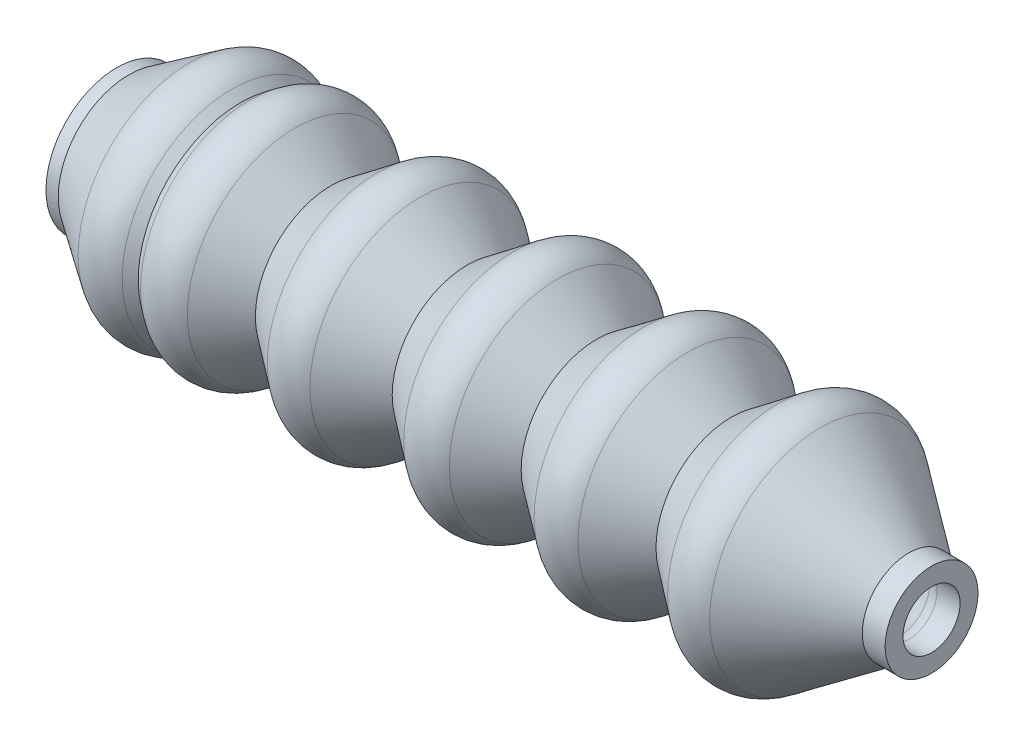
ISO-10303-21;
HEADER;
FILE_DESCRIPTION(('STEP AP214'),'2;1');
FILE_NAME('part.step','',(''),(''),'','','');
FILE_SCHEMA(('AUTOMOTIVE_DESIGN { 1 0 10303 214 1 1 1 1 }'));
ENDSEC;
DATA;
#1=APPLICATION_CONTEXT('core data for automotive mechanical design processes');
#2=APPLICATION_PROTOCOL_DEFINITION('international standard','automotive_design',2000,#1);
#3=PRODUCT_CONTEXT('',#1,'mechanical');
#4=PRODUCT('Part','Part','',(#3));
#5=PRODUCT_RELATED_PRODUCT_CATEGORY('part','',(#4));
#6=PRODUCT_DEFINITION_FORMATION('','',#4);
#7=PRODUCT_DEFINITION_CONTEXT('part definition',#1,'design');
#8=PRODUCT_DEFINITION('design','',#6,#7);
#9=PRODUCT_DEFINITION_SHAPE('','',#8);
#10=(LENGTH_UNIT() NAMED_UNIT(*) SI_UNIT(.MILLI.,.METRE.));
#11=(NAMED_UNIT(*) PLANE_ANGLE_UNIT() SI_UNIT($,.RADIAN.));
#12=(NAMED_UNIT(*) SI_UNIT($,.STERADIAN.) SOLID_ANGLE_UNIT());
#13=UNCERTAINTY_MEASURE_WITH_UNIT(LENGTH_MEASURE(1.E-05),#10,'distance_accuracy_value','');
#14=(GEOMETRIC_REPRESENTATION_CONTEXT(3) GLOBAL_UNCERTAINTY_ASSIGNED_CONTEXT((#13)) GLOBAL_UNIT_ASSIGNED_CONTEXT((#10,
#11,#12)) REPRESENTATION_CONTEXT('',''));
#15=CARTESIAN_POINT('',(0.,0.,0.));
#16=DIRECTION('',(0.,0.,1.));
#17=DIRECTION('',(1.,0.,0.));
#18=AXIS2_PLACEMENT_3D('',#15,#16,#17);
#19=CARTESIAN_POINT('',(235.621796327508,156.349479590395,0.));
#20=DIRECTION('',(1.,0.,0.));
#21=DIRECTION('',(0.,1.,0.));
#22=AXIS2_PLACEMENT_3D('',#19,#20,#21);
#23=PLANE('',#22);
#24=CARTESIAN_POINT('',(235.621796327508,157.626056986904,0.));
#25=DIRECTION('',(1.,0.,0.));
#26=DIRECTION('',(0.,1.,0.));
#27=AXIS2_PLACEMENT_3D('',#24,#25,#26);
#28=CIRCLE('',#27,2.07657739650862);
#29=CARTESIAN_POINT('',(235.621796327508,159.702634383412,0.));
#30=VERTEX_POINT('',#29);
#31=EDGE_CURVE('E34',#30,#30,#28,.F.);
#32=ORIENTED_EDGE('',*,*,#31,.F.);
#33=EDGE_LOOP('',(#32));
#34=FACE_BOUND('',#33,.T.);
#35=CARTESIAN_POINT('',(235.621796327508,157.626056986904,0.));
#36=DIRECTION('',(-1.,0.,0.));
#37=DIRECTION('',(0.,-1.,0.));
#38=AXIS2_PLACEMENT_3D('',#35,#36,#37);
#39=CIRCLE('',#38,1.27657739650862);
#40=CARTESIAN_POINT('',(235.621796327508,156.349479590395,0.));
#41=VERTEX_POINT('',#40);
#42=EDGE_CURVE('E179',#41,#41,#39,.T.);
#43=ORIENTED_EDGE('',*,*,#42,.T.);
#44=EDGE_LOOP('',(#43));
#45=FACE_BOUND('',#44,.T.);
#46=ADVANCED_FACE('F30',(#34,#45),#23,.T.);
#47=CARTESIAN_POINT('',(199.181290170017,155.264478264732,0.));
#48=DIRECTION('',(-1.,0.,0.));
#49=DIRECTION('',(0.,-1.,0.));
#50=AXIS2_PLACEMENT_3D('',#47,#48,#49);
#51=PLANE('',#50);
#52=CARTESIAN_POINT('',(199.181290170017,157.626056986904,0.));
#53=DIRECTION('',(-1.,0.,0.));
#54=DIRECTION('',(0.,-1.,0.));
#55=AXIS2_PLACEMENT_3D('',#52,#53,#54);
#56=CIRCLE('',#55,2.36157872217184);
#57=CARTESIAN_POINT('',(199.181290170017,155.264478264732,0.));
#58=VERTEX_POINT('',#57);
#59=EDGE_CURVE('E98',#58,#58,#56,.T.);
#60=ORIENTED_EDGE('',*,*,#59,.F.);
#61=EDGE_LOOP('',(#60));
#62=FACE_BOUND('',#61,.T.);
#63=CARTESIAN_POINT('',(199.181290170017,157.626056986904,0.));
#64=DIRECTION('',(-1.,0.,0.));
#65=DIRECTION('',(0.,-1.,0.));
#66=AXIS2_PLACEMENT_3D('',#63,#64,#65);
#67=CIRCLE('',#66,3.16157872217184);
#68=CARTESIAN_POINT('',(199.181290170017,154.464478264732,0.));
#69=VERTEX_POINT('',#68);
#70=EDGE_CURVE('E10',#69,#69,#67,.T.);
#71=ORIENTED_EDGE('',*,*,#70,.T.);
#72=EDGE_LOOP('',(#71));
#73=FACE_BOUND('',#72,.T.);
#74=ADVANCED_FACE('F346',(#62,#73),#51,.T.);
#75=CARTESIAN_POINT('',(199.181290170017,157.626056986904,0.));
#76=DIRECTION('',(-1.,0.,0.));
#77=DIRECTION('',(0.,-1.,0.));
#78=AXIS2_PLACEMENT_3D('',#75,#76,#77);
#79=CYLINDRICAL_SURFACE('',#78,3.16157872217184);
#80=CARTESIAN_POINT('',(199.730597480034,157.626056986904,0.));
#81=DIRECTION('',(1.,0.,0.));
#82=DIRECTION('',(0.,1.,0.));
#83=AXIS2_PLACEMENT_3D('',#80,#81,#82);
#84=CIRCLE('',#83,3.16157872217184);
#85=CARTESIAN_POINT('',(199.730597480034,160.787635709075,0.));
#86=VERTEX_POINT('',#85);
#87=EDGE_CURVE('E38',#86,#86,#84,.F.);
#88=ORIENTED_EDGE('',*,*,#87,.T.);
#89=EDGE_LOOP('',(#88));
#90=FACE_BOUND('',#89,.T.);
#91=ORIENTED_EDGE('',*,*,#70,.F.);
#92=EDGE_LOOP('',(#91));
#93=FACE_BOUND('',#92,.T.);
#94=ADVANCED_FACE('F348',(#90,#93),#79,.T.);
#95=CARTESIAN_POINT('',(199.730597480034,157.626056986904,0.));
#96=DIRECTION('',(1.,0.,0.));
#97=DIRECTION('',(0.,1.,0.));
#98=AXIS2_PLACEMENT_3D('',#95,#96,#97);
#99=CONICAL_SURFACE('',#98,3.16157872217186,0.591150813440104);
#100=CARTESIAN_POINT('',(202.436143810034,157.626056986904,0.));
#101=DIRECTION('',(1.,0.,0.));
#102=DIRECTION('',(0.,1.,0.));
#103=AXIS2_PLACEMENT_3D('',#100,#101,#102);
#104=CIRCLE('',#103,4.9776054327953);
#105=CARTESIAN_POINT('',(202.436143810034,162.603662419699,0.));
#106=VERTEX_POINT('',#105);
#107=EDGE_CURVE('E42',#106,#106,#104,.F.);
#108=ORIENTED_EDGE('',*,*,#107,.T.);
#109=EDGE_LOOP('',(#108));
#110=FACE_BOUND('',#109,.T.);
#111=ORIENTED_EDGE('',*,*,#87,.F.);
#112=EDGE_LOOP('',(#111));
#113=FACE_BOUND('',#112,.T.);
#114=ADVANCED_FACE('F354',(#110,#113),#99,.T.);
#115=CARTESIAN_POINT('',(203.327850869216,157.626056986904,0.));
#116=DIRECTION('',(-1.,0.,0.));
#117=DIRECTION('',(0.,-1.,0.));
#118=AXIS2_PLACEMENT_3D('',#115,#116,#117);
#119=TOROIDAL_SURFACE('',#118,3.64912565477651,1.60000000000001);
#120=CARTESIAN_POINT('',(204.327106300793,157.626056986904,0.));
#121=DIRECTION('',(-1.,0.,0.));
#122=DIRECTION('',(0.,-1.,0.));
#123=AXIS2_PLACEMENT_3D('',#120,#121,#122);
#124=CIRCLE('',#123,4.89872102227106);
#125=CARTESIAN_POINT('',(204.327106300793,152.727335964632,0.));
#126=VERTEX_POINT('',#125);
#127=EDGE_CURVE('E93',#126,#126,#124,.T.);
#128=ORIENTED_EDGE('',*,*,#127,.T.);
#129=EDGE_LOOP('',(#128));
#130=FACE_BOUND('',#129,.T.);
#131=ORIENTED_EDGE('',*,*,#107,.F.);
#132=EDGE_LOOP('',(#131));
#133=FACE_BOUND('',#132,.T.);
#134=ADVANCED_FACE('F362',(#130,#133),#119,.T.);
#135=CARTESIAN_POINT('',(204.327106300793,157.626056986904,0.));
#136=DIRECTION('',(-1.,0.,0.));
#137=DIRECTION('',(0.,-1.,0.));
#138=AXIS2_PLACEMENT_3D('',#135,#136,#137);
#139=CONICAL_SURFACE('',#138,4.89872102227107,0.674535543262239);
#140=CARTESIAN_POINT('',(204.725140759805,157.626056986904,0.));
#141=DIRECTION('',(-1.,0.,0.));
#142=DIRECTION('',(0.,-1.,0.));
#143=AXIS2_PLACEMENT_3D('',#140,#141,#142);
#144=CIRCLE('',#143,4.58042751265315);
#145=CARTESIAN_POINT('',(204.725140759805,153.04562947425,0.));
#146=VERTEX_POINT('',#145);
#147=EDGE_CURVE('E90',#146,#146,#144,.T.);
#148=ORIENTED_EDGE('',*,*,#147,.T.);
#149=EDGE_LOOP('',(#148));
#150=FACE_BOUND('',#149,.T.);
#151=ORIENTED_EDGE('',*,*,#127,.F.);
#152=EDGE_LOOP('',(#151));
#153=FACE_BOUND('',#152,.T.);
#154=ADVANCED_FACE('F366',(#150,#153),#139,.T.);
#155=CARTESIAN_POINT('',(204.725140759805,157.626056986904,0.));
#156=DIRECTION('',(1.,0.,0.));
#157=DIRECTION('',(0.,1.,0.));
#158=AXIS2_PLACEMENT_3D('',#155,#156,#157);
#159=CONICAL_SURFACE('',#158,4.58042751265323,0.643298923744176);
#160=CARTESIAN_POINT('',(205.138836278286,157.626056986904,0.));
#161=DIRECTION('',(1.,0.,0.));
#162=DIRECTION('',(0.,1.,0.));
#163=AXIS2_PLACEMENT_3D('',#160,#161,#162);
#164=CIRCLE('',#163,4.8905684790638);
#165=CARTESIAN_POINT('',(205.138836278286,162.516625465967,0.));
#166=VERTEX_POINT('',#165);
#167=EDGE_CURVE('E87',#166,#166,#164,.F.);
#168=ORIENTED_EDGE('',*,*,#167,.T.);
#169=EDGE_LOOP('',(#168));
#170=FACE_BOUND('',#169,.T.);
#171=ORIENTED_EDGE('',*,*,#147,.F.);
#172=EDGE_LOOP('',(#171));
#173=FACE_BOUND('',#172,.T.);
#174=ADVANCED_FACE('F370',(#170,#173),#159,.T.);
#175=CARTESIAN_POINT('',(206.098577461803,157.626056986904,0.));
#176=DIRECTION('',(-1.,0.,0.));
#177=DIRECTION('',(0.,-1.,0.));
#178=AXIS2_PLACEMENT_3D('',#175,#176,#177);
#179=TOROIDAL_SURFACE('',#178,3.61037440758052,1.60000000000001);
#180=CARTESIAN_POINT('',(207.15526681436,157.626056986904,0.));
#181=DIRECTION('',(-1.,0.,0.));
#182=DIRECTION('',(0.,-1.,0.));
#183=AXIS2_PLACEMENT_3D('',#180,#181,#182);
#184=CIRCLE('',#183,4.81179340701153);
#185=CARTESIAN_POINT('',(207.15526681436,152.814263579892,0.));
#186=VERTEX_POINT('',#185);
#187=EDGE_CURVE('E84',#186,#186,#184,.T.);
#188=ORIENTED_EDGE('',*,*,#187,.T.);
#189=EDGE_LOOP('',(#188));
#190=FACE_BOUND('',#189,.T.);
#191=ORIENTED_EDGE('',*,*,#167,.F.);
#192=EDGE_LOOP('',(#191));
#193=FACE_BOUND('',#192,.T.);
#194=ADVANCED_FACE('F374',(#190,#193),#179,.T.);
#195=CARTESIAN_POINT('',(207.15526681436,157.626056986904,0.));
#196=DIRECTION('',(-1.,0.,0.));
#197=DIRECTION('',(0.,-1.,0.));
#198=AXIS2_PLACEMENT_3D('',#195,#196,#197);
#199=CONICAL_SURFACE('',#198,4.8117934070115,0.721392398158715);
#200=CARTESIAN_POINT('',(208.772150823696,157.626056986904,0.));
#201=DIRECTION('',(-1.,0.,0.));
#202=DIRECTION('',(0.,-1.,0.));
#203=AXIS2_PLACEMENT_3D('',#200,#201,#202);
#204=CIRCLE('',#203,3.38968828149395);
#205=CARTESIAN_POINT('',(208.772150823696,154.23636870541,0.));
#206=VERTEX_POINT('',#205);
#207=EDGE_CURVE('E81',#206,#206,#204,.T.);
#208=ORIENTED_EDGE('',*,*,#207,.T.);
#209=EDGE_LOOP('',(#208));
#210=FACE_BOUND('',#209,.T.);
#211=ORIENTED_EDGE('',*,*,#187,.F.);
#212=EDGE_LOOP('',(#211));
#213=FACE_BOUND('',#212,.T.);
#214=ADVANCED_FACE('F378',(#210,#213),#199,.T.);
#215=CARTESIAN_POINT('',(208.772150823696,157.626056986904,0.));
#216=DIRECTION('',(1.,0.,0.));
#217=DIRECTION('',(0.,1.,0.));
#218=AXIS2_PLACEMENT_3D('',#215,#216,#217);
#219=CONICAL_SURFACE('',#218,3.38968828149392,0.638946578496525);
#220=CARTESIAN_POINT('',(210.843005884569,157.626056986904,0.));
#221=DIRECTION('',(1.,0.,0.));
#222=DIRECTION('',(0.,1.,0.));
#223=AXIS2_PLACEMENT_3D('',#220,#221,#222);
#224=CIRCLE('',#223,4.92814250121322);
#225=CARTESIAN_POINT('',(210.843005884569,162.554199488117,0.));
#226=VERTEX_POINT('',#225);
#227=EDGE_CURVE('E78',#226,#226,#224,.F.);
#228=ORIENTED_EDGE('',*,*,#227,.T.);
#229=EDGE_LOOP('',(#228));
#230=FACE_BOUND('',#229,.T.);
#231=ORIENTED_EDGE('',*,*,#207,.F.);
#232=EDGE_LOOP('',(#231));
#233=FACE_BOUND('',#232,.T.);
#234=ADVANCED_FACE('F382',(#230,#233),#219,.T.);
#235=CARTESIAN_POINT('',(211.797166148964,157.626056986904,0.));
#236=DIRECTION('',(-1.,0.,0.));
#237=DIRECTION('',(0.,-1.,0.));
#238=AXIS2_PLACEMENT_3D('',#235,#236,#237);
#239=TOROIDAL_SURFACE('',#238,3.64378344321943,1.6);
#240=CARTESIAN_POINT('',(212.751326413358,157.626056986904,0.));
#241=DIRECTION('',(-1.,0.,0.));
#242=DIRECTION('',(0.,-1.,0.));
#243=AXIS2_PLACEMENT_3D('',#240,#241,#242);
#244=CIRCLE('',#243,4.92814250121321);
#245=CARTESIAN_POINT('',(212.751326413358,152.69791448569,0.));
#246=VERTEX_POINT('',#245);
#247=EDGE_CURVE('E75',#246,#246,#244,.T.);
#248=ORIENTED_EDGE('',*,*,#247,.T.);
#249=EDGE_LOOP('',(#248));
#250=FACE_BOUND('',#249,.T.);
#251=ORIENTED_EDGE('',*,*,#227,.F.);
#252=EDGE_LOOP('',(#251));
#253=FACE_BOUND('',#252,.T.);
#254=ADVANCED_FACE('F386',(#250,#253),#239,.T.);
#255=CARTESIAN_POINT('',(212.751326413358,157.626056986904,0.));
#256=DIRECTION('',(-1.,0.,0.));
#257=DIRECTION('',(0.,-1.,0.));
#258=AXIS2_PLACEMENT_3D('',#255,#256,#257);
#259=CONICAL_SURFACE('',#258,4.92814250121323,0.638946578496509);
#260=CARTESIAN_POINT('',(214.862252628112,157.626056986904,0.));
#261=DIRECTION('',(-1.,0.,0.));
#262=DIRECTION('',(0.,-1.,0.));
#263=AXIS2_PLACEMENT_3D('',#260,#261,#262);
#264=CIRCLE('',#263,3.35991911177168);
#265=CARTESIAN_POINT('',(214.862252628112,154.266137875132,0.));
#266=VERTEX_POINT('',#265);
#267=EDGE_CURVE('E72',#266,#266,#264,.T.);
#268=ORIENTED_EDGE('',*,*,#267,.T.);
#269=EDGE_LOOP('',(#268));
#270=FACE_BOUND('',#269,.T.);
#271=ORIENTED_EDGE('',*,*,#247,.F.);
#272=EDGE_LOOP('',(#271));
#273=FACE_BOUND('',#272,.T.);
#274=ADVANCED_FACE('F390',(#270,#273),#259,.T.);
#275=CARTESIAN_POINT('',(214.862252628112,157.626056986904,0.));
#276=DIRECTION('',(1.,0.,0.));
#277=DIRECTION('',(0.,1.,0.));
#278=AXIS2_PLACEMENT_3D('',#275,#276,#277);
#279=CONICAL_SURFACE('',#278,3.35991911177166,0.643623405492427);
#280=CARTESIAN_POINT('',(216.913695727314,157.626056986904,0.));
#281=DIRECTION('',(1.,0.,0.));
#282=DIRECTION('',(0.,1.,0.));
#283=AXIS2_PLACEMENT_3D('',#280,#281,#282);
#284=CIRCLE('',#283,4.89889347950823);
#285=CARTESIAN_POINT('',(216.913695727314,162.524950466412,0.));
#286=VERTEX_POINT('',#285);
#287=EDGE_CURVE('E69',#286,#286,#284,.F.);
#288=ORIENTED_EDGE('',*,*,#287,.T.);
#289=EDGE_LOOP('',(#288));
#290=FACE_BOUND('',#289,.T.);
#291=ORIENTED_EDGE('',*,*,#267,.F.);
#292=EDGE_LOOP('',(#291));
#293=FACE_BOUND('',#292,.T.);
#294=ADVANCED_FACE('F394',(#290,#293),#279,.T.);
#295=CARTESIAN_POINT('',(217.873852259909,157.626056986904,0.));
#296=DIRECTION('',(-1.,0.,0.));
#297=DIRECTION('',(0.,-1.,0.));
#298=AXIS2_PLACEMENT_3D('',#295,#296,#297);
#299=TOROIDAL_SURFACE('',#298,3.61901089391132,1.59999999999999);
#300=CARTESIAN_POINT('',(218.903586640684,157.626056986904,0.));
#301=DIRECTION('',(-1.,0.,0.));
#302=DIRECTION('',(0.,-1.,0.));
#303=AXIS2_PLACEMENT_3D('',#300,#301,#302);
#304=CIRCLE('',#303,4.84361168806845);
#305=CARTESIAN_POINT('',(218.903586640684,152.782445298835,0.));
#306=VERTEX_POINT('',#305);
#307=EDGE_CURVE('E66',#306,#306,#304,.T.);
#308=ORIENTED_EDGE('',*,*,#307,.T.);
#309=EDGE_LOOP('',(#308));
#310=FACE_BOUND('',#309,.T.);
#311=ORIENTED_EDGE('',*,*,#287,.F.);
#312=EDGE_LOOP('',(#311));
#313=FACE_BOUND('',#312,.T.);
#314=ADVANCED_FACE('F398',(#310,#313),#299,.T.);
#315=CARTESIAN_POINT('',(218.903586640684,157.626056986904,0.));
#316=DIRECTION('',(-1.,0.,0.));
#317=DIRECTION('',(0.,-1.,0.));
#318=AXIS2_PLACEMENT_3D('',#315,#316,#317);
#319=CONICAL_SURFACE('',#318,4.84361168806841,0.699171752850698);
#320=CARTESIAN_POINT('',(220.64753714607,157.626056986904,0.));
#321=DIRECTION('',(-1.,0.,0.));
#322=DIRECTION('',(0.,-1.,0.));
#323=AXIS2_PLACEMENT_3D('',#320,#321,#322);
#324=CIRCLE('',#323,3.37716988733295);
#325=CARTESIAN_POINT('',(220.64753714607,154.248887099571,0.));
#326=VERTEX_POINT('',#325);
#327=EDGE_CURVE('E63',#326,#326,#324,.T.);
#328=ORIENTED_EDGE('',*,*,#327,.T.);
#329=EDGE_LOOP('',(#328));
#330=FACE_BOUND('',#329,.T.);
#331=ORIENTED_EDGE('',*,*,#307,.F.);
#332=EDGE_LOOP('',(#331));
#333=FACE_BOUND('',#332,.T.);
#334=ADVANCED_FACE('F402',(#330,#333),#319,.T.);
#335=CARTESIAN_POINT('',(220.64753714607,157.626056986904,0.));
#336=DIRECTION('',(1.,0.,0.));
#337=DIRECTION('',(0.,1.,0.));
#338=AXIS2_PLACEMENT_3D('',#335,#336,#337);
#339=CONICAL_SURFACE('',#338,3.37716988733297,0.629766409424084);
#340=CARTESIAN_POINT('',(222.780315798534,157.626056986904,0.));
#341=DIRECTION('',(1.,0.,0.));
#342=DIRECTION('',(0.,1.,0.));
#343=AXIS2_PLACEMENT_3D('',#340,#341,#342);
#344=CIRCLE('',#343,4.93144730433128);
#345=CARTESIAN_POINT('',(222.780315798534,162.557504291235,0.));
#346=VERTEX_POINT('',#345);
#347=EDGE_CURVE('E60',#346,#346,#344,.F.);
#348=ORIENTED_EDGE('',*,*,#347,.T.);
#349=EDGE_LOOP('',(#348));
#350=FACE_BOUND('',#349,.T.);
#351=ORIENTED_EDGE('',*,*,#327,.F.);
#352=EDGE_LOOP('',(#351));
#353=FACE_BOUND('',#352,.T.);
#354=ADVANCED_FACE('F406',(#350,#353),#339,.T.);
#355=CARTESIAN_POINT('',(223.72264538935,157.626056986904,0.));
#356=DIRECTION('',(-1.,0.,0.));
#357=DIRECTION('',(0.,-1.,0.));
#358=AXIS2_PLACEMENT_3D('',#355,#356,#357);
#359=TOROIDAL_SURFACE('',#358,3.63838313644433,1.59999999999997);
#360=CARTESIAN_POINT('',(224.707332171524,157.626056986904,0.));
#361=DIRECTION('',(-1.,0.,0.));
#362=DIRECTION('',(0.,-1.,0.));
#363=AXIS2_PLACEMENT_3D('',#360,#361,#362);
#364=CIRCLE('',#363,4.89949056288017);
#365=CARTESIAN_POINT('',(224.707332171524,152.726566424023,0.));
#366=VERTEX_POINT('',#365);
#367=EDGE_CURVE('E57',#366,#366,#364,.T.);
#368=ORIENTED_EDGE('',*,*,#367,.T.);
#369=EDGE_LOOP('',(#368));
#370=FACE_BOUND('',#369,.T.);
#371=ORIENTED_EDGE('',*,*,#347,.F.);
#372=EDGE_LOOP('',(#371));
#373=FACE_BOUND('',#372,.T.);
#374=ADVANCED_FACE('F410',(#370,#373),#359,.T.);
#375=CARTESIAN_POINT('',(224.707332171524,157.626056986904,0.));
#376=DIRECTION('',(-1.,0.,0.));
#377=DIRECTION('',(0.,-1.,0.));
#378=AXIS2_PLACEMENT_3D('',#375,#376,#377);
#379=CONICAL_SURFACE('',#378,4.89949056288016,0.662930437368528);
#380=CARTESIAN_POINT('',(226.667504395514,157.626056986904,0.));
#381=DIRECTION('',(-1.,0.,0.));
#382=DIRECTION('',(0.,-1.,0.));
#383=AXIS2_PLACEMENT_3D('',#380,#381,#382);
#384=CIRCLE('',#383,3.36896616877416);
#385=CARTESIAN_POINT('',(226.667504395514,154.257090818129,0.));
#386=VERTEX_POINT('',#385);
#387=EDGE_CURVE('E54',#386,#386,#384,.T.);
#388=ORIENTED_EDGE('',*,*,#387,.T.);
#389=EDGE_LOOP('',(#388));
#390=FACE_BOUND('',#389,.T.);
#391=ORIENTED_EDGE('',*,*,#367,.F.);
#392=EDGE_LOOP('',(#391));
#393=FACE_BOUND('',#392,.T.);
#394=ADVANCED_FACE('F414',(#390,#393),#379,.T.);
#395=CARTESIAN_POINT('',(226.667504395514,157.626056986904,0.));
#396=DIRECTION('',(1.,0.,0.));
#397=DIRECTION('',(0.,1.,0.));
#398=AXIS2_PLACEMENT_3D('',#395,#396,#397);
#399=CONICAL_SURFACE('',#398,3.36896616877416,0.643623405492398);
#400=CARTESIAN_POINT('',(228.743678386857,157.626056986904,0.));
#401=DIRECTION('',(1.,0.,0.));
#402=DIRECTION('',(0.,1.,0.));
#403=AXIS2_PLACEMENT_3D('',#400,#401,#402);
#404=CIRCLE('',#403,4.92649343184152);
#405=CARTESIAN_POINT('',(228.743678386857,162.552550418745,0.));
#406=VERTEX_POINT('',#405);
#407=EDGE_CURVE('E51',#406,#406,#404,.F.);
#408=ORIENTED_EDGE('',*,*,#407,.T.);
#409=EDGE_LOOP('',(#408));
#410=FACE_BOUND('',#409,.T.);
#411=ORIENTED_EDGE('',*,*,#387,.F.);
#412=EDGE_LOOP('',(#411));
#413=FACE_BOUND('',#412,.T.);
#414=ADVANCED_FACE('F418',(#410,#413),#399,.T.);
#415=CARTESIAN_POINT('',(229.703834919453,157.626056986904,0.));
#416=DIRECTION('',(-1.,0.,0.));
#417=DIRECTION('',(0.,-1.,0.));
#418=AXIS2_PLACEMENT_3D('',#415,#416,#417);
#419=TOROIDAL_SURFACE('',#418,3.64661084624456,1.59999999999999);
#420=CARTESIAN_POINT('',(230.64217922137,157.626056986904,0.));
#421=DIRECTION('',(-1.,0.,0.));
#422=DIRECTION('',(0.,-1.,0.));
#423=AXIS2_PLACEMENT_3D('',#420,#421,#422);
#424=CIRCLE('',#423,4.94256993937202);
#425=CARTESIAN_POINT('',(230.64217922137,152.683487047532,0.));
#426=VERTEX_POINT('',#425);
#427=EDGE_CURVE('E48',#426,#426,#424,.T.);
#428=ORIENTED_EDGE('',*,*,#427,.T.);
#429=EDGE_LOOP('',(#428));
#430=FACE_BOUND('',#429,.T.);
#431=ORIENTED_EDGE('',*,*,#407,.F.);
#432=EDGE_LOOP('',(#431));
#433=FACE_BOUND('',#432,.T.);
#434=ADVANCED_FACE('F422',(#430,#433),#419,.T.);
#435=CARTESIAN_POINT('',(230.64217922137,157.626056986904,0.));
#436=DIRECTION('',(-1.,0.,0.));
#437=DIRECTION('',(0.,-1.,0.));
#438=AXIS2_PLACEMENT_3D('',#435,#436,#437);
#439=CONICAL_SURFACE('',#438,4.94256993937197,0.626687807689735);
#440=CARTESIAN_POINT('',(234.600437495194,157.626056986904,0.));
#441=DIRECTION('',(-1.,0.,0.));
#442=DIRECTION('',(0.,-1.,0.));
#443=AXIS2_PLACEMENT_3D('',#440,#441,#442);
#444=CIRCLE('',#443,2.07657739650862);
#445=CARTESIAN_POINT('',(234.600437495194,155.549479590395,0.));
#446=VERTEX_POINT('',#445);
#447=EDGE_CURVE('E45',#446,#446,#444,.T.);
#448=ORIENTED_EDGE('',*,*,#447,.T.);
#449=EDGE_LOOP('',(#448));
#450=FACE_BOUND('',#449,.T.);
#451=ORIENTED_EDGE('',*,*,#427,.F.);
#452=EDGE_LOOP('',(#451));
#453=FACE_BOUND('',#452,.T.);
#454=ADVANCED_FACE('F425',(#450,#453),#439,.T.);
#455=CARTESIAN_POINT('',(199.181290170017,157.626056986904,0.));
#456=DIRECTION('',(-1.,0.,0.));
#457=DIRECTION('',(0.,-1.,0.));
#458=AXIS2_PLACEMENT_3D('',#455,#456,#457);
#459=CYLINDRICAL_SURFACE('',#458,2.07657739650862);
#460=ORIENTED_EDGE('',*,*,#31,.T.);
#461=EDGE_LOOP('',(#460));
#462=FACE_BOUND('',#461,.T.);
#463=ORIENTED_EDGE('',*,*,#447,.F.);
#464=EDGE_LOOP('',(#463));
#465=FACE_BOUND('',#464,.T.);
#466=ADVANCED_FACE('F32',(#462,#465),#459,.T.);
#467=CARTESIAN_POINT('',(199.181290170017,157.626056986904,0.));
#468=DIRECTION('',(-1.,0.,0.));
#469=DIRECTION('',(0.,-1.,0.));
#470=AXIS2_PLACEMENT_3D('',#467,#468,#469);
#471=CYLINDRICAL_SURFACE('',#470,2.36157872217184);
#472=CARTESIAN_POINT('',(199.730597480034,157.626056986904,0.));
#473=DIRECTION('',(-1.,0.,0.));
#474=DIRECTION('',(0.,-1.,0.));
#475=AXIS2_PLACEMENT_3D('',#472,#473,#474);
#476=CIRCLE('',#475,2.36157872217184);
#477=CARTESIAN_POINT('',(199.730597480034,155.264478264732,0.));
#478=VERTEX_POINT('',#477);
#479=EDGE_CURVE('E101',#478,#478,#476,.T.);
#480=ORIENTED_EDGE('',*,*,#479,.F.);
#481=EDGE_LOOP('',(#480));
#482=FACE_BOUND('',#481,.T.);
#483=ORIENTED_EDGE('',*,*,#59,.T.);
#484=EDGE_LOOP('',(#483));
#485=FACE_BOUND('',#484,.T.);
#486=ADVANCED_FACE('F337',(#482,#485),#471,.F.);
#487=CARTESIAN_POINT('',(199.730597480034,157.626056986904,0.));
#488=DIRECTION('',(-1.,0.,0.));
#489=DIRECTION('',(0.,-1.,0.));
#490=AXIS2_PLACEMENT_3D('',#487,#488,#489);
#491=TOROIDAL_SURFACE('',#490,3.16157872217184,0.799999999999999);
#492=CARTESIAN_POINT('',(200.176451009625,157.626056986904,0.));
#493=DIRECTION('',(-1.,0.,0.));
#494=DIRECTION('',(0.,-1.,0.));
#495=AXIS2_PLACEMENT_3D('',#492,#493,#494);
#496=CIRCLE('',#495,2.49733883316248);
#497=CARTESIAN_POINT('',(200.176451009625,155.128718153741,0.));
#498=VERTEX_POINT('',#497);
#499=EDGE_CURVE('E104',#498,#498,#496,.T.);
#500=ORIENTED_EDGE('',*,*,#499,.F.);
#501=EDGE_LOOP('',(#500));
#502=FACE_BOUND('',#501,.T.);
#503=ORIENTED_EDGE('',*,*,#479,.T.);
#504=EDGE_LOOP('',(#503));
#505=FACE_BOUND('',#504,.T.);
#506=ADVANCED_FACE('F331',(#502,#505),#491,.T.);
#507=CARTESIAN_POINT('',(200.176451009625,157.626056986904,0.));
#508=DIRECTION('',(1.,0.,0.));
#509=DIRECTION('',(0.,1.,0.));
#510=AXIS2_PLACEMENT_3D('',#507,#508,#509);
#511=CONICAL_SURFACE('',#510,2.49733883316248,0.591150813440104);
#512=CARTESIAN_POINT('',(202.881997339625,157.626056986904,0.));
#513=DIRECTION('',(-1.,0.,0.));
#514=DIRECTION('',(0.,-1.,0.));
#515=AXIS2_PLACEMENT_3D('',#512,#513,#514);
#516=CIRCLE('',#515,4.31336554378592);
#517=CARTESIAN_POINT('',(202.881997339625,153.312691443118,0.));
#518=VERTEX_POINT('',#517);
#519=EDGE_CURVE('E107',#518,#518,#516,.T.);
#520=ORIENTED_EDGE('',*,*,#519,.F.);
#521=EDGE_LOOP('',(#520));
#522=FACE_BOUND('',#521,.T.);
#523=ORIENTED_EDGE('',*,*,#499,.T.);
#524=EDGE_LOOP('',(#523));
#525=FACE_BOUND('',#524,.T.);
#526=ADVANCED_FACE('F325',(#522,#525),#511,.F.);
#527=CARTESIAN_POINT('',(203.327850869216,157.626056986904,0.));
#528=DIRECTION('',(-1.,0.,0.));
#529=DIRECTION('',(0.,-1.,0.));
#530=AXIS2_PLACEMENT_3D('',#527,#528,#529);
#531=TOROIDAL_SURFACE('',#530,3.64912565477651,0.800000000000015);
#532=CARTESIAN_POINT('',(203.827478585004,157.626056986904,0.));
#533=DIRECTION('',(-1.,0.,0.));
#534=DIRECTION('',(0.,-1.,0.));
#535=AXIS2_PLACEMENT_3D('',#532,#533,#534);
#536=CIRCLE('',#535,4.27392333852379);
#537=CARTESIAN_POINT('',(203.827478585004,153.35213364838,0.));
#538=VERTEX_POINT('',#537);
#539=EDGE_CURVE('E110',#538,#538,#536,.T.);
#540=ORIENTED_EDGE('',*,*,#539,.F.);
#541=EDGE_LOOP('',(#540));
#542=FACE_BOUND('',#541,.T.);
#543=ORIENTED_EDGE('',*,*,#519,.T.);
#544=EDGE_LOOP('',(#543));
#545=FACE_BOUND('',#544,.T.);
#546=ADVANCED_FACE('F319',(#542,#545),#531,.F.);
#547=CARTESIAN_POINT('',(203.827478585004,157.626056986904,0.));
#548=DIRECTION('',(-1.,0.,0.));
#549=DIRECTION('',(0.,-1.,0.));
#550=AXIS2_PLACEMENT_3D('',#547,#548,#549);
#551=CONICAL_SURFACE('',#550,4.27392333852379,0.674535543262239);
#552=CARTESIAN_POINT('',(204.225513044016,157.626056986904,0.));
#553=DIRECTION('',(-1.,0.,0.));
#554=DIRECTION('',(0.,-1.,0.));
#555=AXIS2_PLACEMENT_3D('',#552,#553,#554);
#556=CIRCLE('',#555,3.95562982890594);
#557=CARTESIAN_POINT('',(204.225513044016,153.670427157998,0.));
#558=VERTEX_POINT('',#557);
#559=EDGE_CURVE('E113',#558,#558,#556,.T.);
#560=ORIENTED_EDGE('',*,*,#559,.F.);
#561=EDGE_LOOP('',(#560));
#562=FACE_BOUND('',#561,.T.);
#563=ORIENTED_EDGE('',*,*,#539,.T.);
#564=EDGE_LOOP('',(#563));
#565=FACE_BOUND('',#564,.T.);
#566=ADVANCED_FACE('F313',(#562,#565),#551,.F.);
#567=CARTESIAN_POINT('',(204.725140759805,157.626056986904,0.));
#568=DIRECTION('',(-1.,0.,0.));
#569=DIRECTION('',(0.,-1.,0.));
#570=AXIS2_PLACEMENT_3D('',#567,#568,#569);
#571=TOROIDAL_SURFACE('',#570,4.58042751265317,0.800000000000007);
#572=CARTESIAN_POINT('',(205.205011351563,157.626056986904,0.));
#573=DIRECTION('',(-1.,0.,0.));
#574=DIRECTION('',(0.,-1.,0.));
#575=AXIS2_PLACEMENT_3D('',#572,#573,#574);
#576=CIRCLE('',#575,3.94033047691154);
#577=CARTESIAN_POINT('',(205.205011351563,153.685726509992,0.));
#578=VERTEX_POINT('',#577);
#579=EDGE_CURVE('E116',#578,#578,#576,.T.);
#580=ORIENTED_EDGE('',*,*,#579,.F.);
#581=EDGE_LOOP('',(#580));
#582=FACE_BOUND('',#581,.T.);
#583=ORIENTED_EDGE('',*,*,#559,.T.);
#584=EDGE_LOOP('',(#583));
#585=FACE_BOUND('',#584,.T.);
#586=ADVANCED_FACE('F307',(#582,#585),#571,.T.);
#587=CARTESIAN_POINT('',(205.205011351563,157.626056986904,0.));
#588=DIRECTION('',(1.,0.,0.));
#589=DIRECTION('',(0.,1.,0.));
#590=AXIS2_PLACEMENT_3D('',#587,#588,#589);
#591=CONICAL_SURFACE('',#590,3.94033047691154,0.643298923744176);
#592=CARTESIAN_POINT('',(205.618706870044,157.626056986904,0.));
#593=DIRECTION('',(-1.,0.,0.));
#594=DIRECTION('',(0.,-1.,0.));
#595=AXIS2_PLACEMENT_3D('',#592,#593,#594);
#596=CIRCLE('',#595,4.25047144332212);
#597=CARTESIAN_POINT('',(205.618706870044,153.375585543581,0.));
#598=VERTEX_POINT('',#597);
#599=EDGE_CURVE('E119',#598,#598,#596,.T.);
#600=ORIENTED_EDGE('',*,*,#599,.F.);
#601=EDGE_LOOP('',(#600));
#602=FACE_BOUND('',#601,.T.);
#603=ORIENTED_EDGE('',*,*,#579,.T.);
#604=EDGE_LOOP('',(#603));
#605=FACE_BOUND('',#604,.T.);
#606=ADVANCED_FACE('F301',(#602,#605),#591,.F.);
#607=CARTESIAN_POINT('',(206.098577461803,157.626056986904,0.));
#608=DIRECTION('',(-1.,0.,0.));
#609=DIRECTION('',(0.,-1.,0.));
#610=AXIS2_PLACEMENT_3D('',#607,#608,#609);
#611=TOROIDAL_SURFACE('',#610,3.61037440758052,0.800000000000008);
#612=CARTESIAN_POINT('',(206.626922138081,157.626056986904,0.));
#613=DIRECTION('',(-1.,0.,0.));
#614=DIRECTION('',(0.,-1.,0.));
#615=AXIS2_PLACEMENT_3D('',#612,#613,#614);
#616=CIRCLE('',#615,4.21108390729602);
#617=CARTESIAN_POINT('',(206.626922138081,153.414973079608,0.));
#618=VERTEX_POINT('',#617);
#619=EDGE_CURVE('E122',#618,#618,#616,.T.);
#620=ORIENTED_EDGE('',*,*,#619,.F.);
#621=EDGE_LOOP('',(#620));
#622=FACE_BOUND('',#621,.T.);
#623=ORIENTED_EDGE('',*,*,#599,.T.);
#624=EDGE_LOOP('',(#623));
#625=FACE_BOUND('',#624,.T.);
#626=ADVANCED_FACE('F295',(#622,#625),#611,.F.);
#627=CARTESIAN_POINT('',(206.626922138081,157.626056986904,0.));
#628=DIRECTION('',(-1.,0.,0.));
#629=DIRECTION('',(0.,-1.,0.));
#630=AXIS2_PLACEMENT_3D('',#627,#628,#629);
#631=CONICAL_SURFACE('',#630,4.21108390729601,0.721392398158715);
#632=CARTESIAN_POINT('',(208.243806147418,157.626056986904,0.));
#633=DIRECTION('',(-1.,0.,0.));
#634=DIRECTION('',(0.,-1.,0.));
#635=AXIS2_PLACEMENT_3D('',#632,#633,#634);
#636=CIRCLE('',#635,2.7889787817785);
#637=CARTESIAN_POINT('',(208.243806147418,154.837078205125,0.));
#638=VERTEX_POINT('',#637);
#639=EDGE_CURVE('E125',#638,#638,#636,.T.);
#640=ORIENTED_EDGE('',*,*,#639,.F.);
#641=EDGE_LOOP('',(#640));
#642=FACE_BOUND('',#641,.T.);
#643=ORIENTED_EDGE('',*,*,#619,.T.);
#644=EDGE_LOOP('',(#643));
#645=FACE_BOUND('',#644,.T.);
#646=ADVANCED_FACE('F289',(#642,#645),#631,.F.);
#647=CARTESIAN_POINT('',(208.772150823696,157.626056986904,0.));
#648=DIRECTION('',(-1.,0.,0.));
#649=DIRECTION('',(0.,-1.,0.));
#650=AXIS2_PLACEMENT_3D('',#647,#648,#649);
#651=TOROIDAL_SURFACE('',#650,3.38968828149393,0.799999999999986);
#652=CARTESIAN_POINT('',(209.249230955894,157.626056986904,0.));
#653=DIRECTION('',(-1.,0.,0.));
#654=DIRECTION('',(0.,-1.,0.));
#655=AXIS2_PLACEMENT_3D('',#652,#653,#654);
#656=CIRCLE('',#655,2.74750875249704);
#657=CARTESIAN_POINT('',(209.249230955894,154.878548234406,0.));
#658=VERTEX_POINT('',#657);
#659=EDGE_CURVE('E128',#658,#658,#656,.T.);
#660=ORIENTED_EDGE('',*,*,#659,.F.);
#661=EDGE_LOOP('',(#660));
#662=FACE_BOUND('',#661,.T.);
#663=ORIENTED_EDGE('',*,*,#639,.T.);
#664=EDGE_LOOP('',(#663));
#665=FACE_BOUND('',#664,.T.);
#666=ADVANCED_FACE('F283',(#662,#665),#651,.T.);
#667=CARTESIAN_POINT('',(209.249230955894,157.626056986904,0.));
#668=DIRECTION('',(1.,0.,0.));
#669=DIRECTION('',(0.,1.,0.));
#670=AXIS2_PLACEMENT_3D('',#667,#668,#669);
#671=CONICAL_SURFACE('',#670,2.74750875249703,0.638946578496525);
#672=CARTESIAN_POINT('',(211.320086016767,157.626056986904,0.));
#673=DIRECTION('',(-1.,0.,0.));
#674=DIRECTION('',(0.,-1.,0.));
#675=AXIS2_PLACEMENT_3D('',#672,#673,#674);
#676=CIRCLE('',#675,4.28596297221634);
#677=CARTESIAN_POINT('',(211.320086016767,153.340094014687,0.));
#678=VERTEX_POINT('',#677);
#679=EDGE_CURVE('E131',#678,#678,#676,.T.);
#680=ORIENTED_EDGE('',*,*,#679,.F.);
#681=EDGE_LOOP('',(#680));
#682=FACE_BOUND('',#681,.T.);
#683=ORIENTED_EDGE('',*,*,#659,.T.);
#684=EDGE_LOOP('',(#683));
#685=FACE_BOUND('',#684,.T.);
#686=ADVANCED_FACE('F277',(#682,#685),#671,.F.);
#687=CARTESIAN_POINT('',(211.797166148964,157.626056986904,0.));
#688=DIRECTION('',(-1.,0.,0.));
#689=DIRECTION('',(0.,-1.,0.));
#690=AXIS2_PLACEMENT_3D('',#687,#688,#689);
#691=TOROIDAL_SURFACE('',#690,3.64378344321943,0.800000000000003);
#692=CARTESIAN_POINT('',(212.274246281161,157.626056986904,0.));
#693=DIRECTION('',(-1.,0.,0.));
#694=DIRECTION('',(0.,-1.,0.));
#695=AXIS2_PLACEMENT_3D('',#692,#693,#694);
#696=CIRCLE('',#695,4.28596297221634);
#697=CARTESIAN_POINT('',(212.274246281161,153.340094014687,0.));
#698=VERTEX_POINT('',#697);
#699=EDGE_CURVE('E134',#698,#698,#696,.T.);
#700=ORIENTED_EDGE('',*,*,#699,.F.);
#701=EDGE_LOOP('',(#700));
#702=FACE_BOUND('',#701,.T.);
#703=ORIENTED_EDGE('',*,*,#679,.T.);
#704=EDGE_LOOP('',(#703));
#705=FACE_BOUND('',#704,.T.);
#706=ADVANCED_FACE('F271',(#702,#705),#691,.F.);
#707=CARTESIAN_POINT('',(212.274246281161,157.626056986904,0.));
#708=DIRECTION('',(-1.,0.,0.));
#709=DIRECTION('',(0.,-1.,0.));
#710=AXIS2_PLACEMENT_3D('',#707,#708,#709);
#711=CONICAL_SURFACE('',#710,4.28596297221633,0.638946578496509);
#712=CARTESIAN_POINT('',(214.385172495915,157.626056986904,0.));
#713=DIRECTION('',(-1.,0.,0.));
#714=DIRECTION('',(0.,-1.,0.));
#715=AXIS2_PLACEMENT_3D('',#712,#713,#714);
#716=CIRCLE('',#715,2.71773958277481);
#717=CARTESIAN_POINT('',(214.385172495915,154.908317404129,0.));
#718=VERTEX_POINT('',#717);
#719=EDGE_CURVE('E137',#718,#718,#716,.T.);
#720=ORIENTED_EDGE('',*,*,#719,.F.);
#721=EDGE_LOOP('',(#720));
#722=FACE_BOUND('',#721,.T.);
#723=ORIENTED_EDGE('',*,*,#699,.T.);
#724=EDGE_LOOP('',(#723));
#725=FACE_BOUND('',#724,.T.);
#726=ADVANCED_FACE('F265',(#722,#725),#711,.F.);
#727=CARTESIAN_POINT('',(214.862252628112,157.626056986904,0.));
#728=DIRECTION('',(-1.,0.,0.));
#729=DIRECTION('',(0.,-1.,0.));
#730=AXIS2_PLACEMENT_3D('',#727,#728,#729);
#731=TOROIDAL_SURFACE('',#730,3.35991911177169,0.800000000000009);
#732=CARTESIAN_POINT('',(215.34233089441,157.626056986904,0.));
#733=DIRECTION('',(-1.,0.,0.));
#734=DIRECTION('',(0.,-1.,0.));
#735=AXIS2_PLACEMENT_3D('',#732,#733,#734);
#736=CIRCLE('',#735,2.71997781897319);
#737=CARTESIAN_POINT('',(215.34233089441,154.90607916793,0.));
#738=VERTEX_POINT('',#737);
#739=EDGE_CURVE('E140',#738,#738,#736,.T.);
#740=ORIENTED_EDGE('',*,*,#739,.F.);
#741=EDGE_LOOP('',(#740));
#742=FACE_BOUND('',#741,.T.);
#743=ORIENTED_EDGE('',*,*,#719,.T.);
#744=EDGE_LOOP('',(#743));
#745=FACE_BOUND('',#744,.T.);
#746=ADVANCED_FACE('F259',(#742,#745),#731,.T.);
#747=CARTESIAN_POINT('',(215.34233089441,157.626056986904,0.));
#748=DIRECTION('',(1.,0.,0.));
#749=DIRECTION('',(0.,1.,0.));
#750=AXIS2_PLACEMENT_3D('',#747,#748,#749);
#751=CONICAL_SURFACE('',#750,2.71997781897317,0.643623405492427);
#752=CARTESIAN_POINT('',(217.393773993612,157.626056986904,0.));
#753=DIRECTION('',(-1.,0.,0.));
#754=DIRECTION('',(0.,-1.,0.));
#755=AXIS2_PLACEMENT_3D('',#752,#753,#754);
#756=CIRCLE('',#755,4.25895218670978);
#757=CARTESIAN_POINT('',(217.393773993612,153.367104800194,0.));
#758=VERTEX_POINT('',#757);
#759=EDGE_CURVE('E143',#758,#758,#756,.T.);
#760=ORIENTED_EDGE('',*,*,#759,.F.);
#761=EDGE_LOOP('',(#760));
#762=FACE_BOUND('',#761,.T.);
#763=ORIENTED_EDGE('',*,*,#739,.T.);
#764=EDGE_LOOP('',(#763));
#765=FACE_BOUND('',#764,.T.);
#766=ADVANCED_FACE('F253',(#762,#765),#751,.F.);
#767=CARTESIAN_POINT('',(217.873852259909,157.626056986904,0.));
#768=DIRECTION('',(-1.,0.,0.));
#769=DIRECTION('',(0.,-1.,0.));
#770=AXIS2_PLACEMENT_3D('',#767,#768,#769);
#771=TOROIDAL_SURFACE('',#770,3.61901089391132,0.799999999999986);
#772=CARTESIAN_POINT('',(218.388719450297,157.626056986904,0.));
#773=DIRECTION('',(-1.,0.,0.));
#774=DIRECTION('',(0.,-1.,0.));
#775=AXIS2_PLACEMENT_3D('',#772,#773,#774);
#776=CIRCLE('',#775,4.23131129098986);
#777=CARTESIAN_POINT('',(218.388719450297,153.394745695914,0.));
#778=VERTEX_POINT('',#777);
#779=EDGE_CURVE('E146',#778,#778,#776,.T.);
#780=ORIENTED_EDGE('',*,*,#779,.F.);
#781=EDGE_LOOP('',(#780));
#782=FACE_BOUND('',#781,.T.);
#783=ORIENTED_EDGE('',*,*,#759,.T.);
#784=EDGE_LOOP('',(#783));
#785=FACE_BOUND('',#784,.T.);
#786=ADVANCED_FACE('F247',(#782,#785),#771,.F.);
#787=CARTESIAN_POINT('',(218.388719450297,157.626056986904,0.));
#788=DIRECTION('',(-1.,0.,0.));
#789=DIRECTION('',(0.,-1.,0.));
#790=AXIS2_PLACEMENT_3D('',#787,#788,#789);
#791=CONICAL_SURFACE('',#790,4.23131129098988,0.699171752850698);
#792=CARTESIAN_POINT('',(220.132669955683,157.626056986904,0.));
#793=DIRECTION('',(-1.,0.,0.));
#794=DIRECTION('',(0.,-1.,0.));
#795=AXIS2_PLACEMENT_3D('',#792,#793,#794);
#796=CIRCLE('',#795,2.76486949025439);
#797=CARTESIAN_POINT('',(220.132669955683,154.861187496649,0.));
#798=VERTEX_POINT('',#797);
#799=EDGE_CURVE('E149',#798,#798,#796,.T.);
#800=ORIENTED_EDGE('',*,*,#799,.F.);
#801=EDGE_LOOP('',(#800));
#802=FACE_BOUND('',#801,.T.);
#803=ORIENTED_EDGE('',*,*,#779,.T.);
#804=EDGE_LOOP('',(#803));
#805=FACE_BOUND('',#804,.T.);
#806=ADVANCED_FACE('F241',(#802,#805),#791,.F.);
#807=CARTESIAN_POINT('',(220.64753714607,157.626056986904,0.));
#808=DIRECTION('',(-1.,0.,0.));
#809=DIRECTION('',(0.,-1.,0.));
#810=AXIS2_PLACEMENT_3D('',#807,#808,#809);
#811=TOROIDAL_SURFACE('',#810,3.37716988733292,0.799999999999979);
#812=CARTESIAN_POINT('',(221.118701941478,157.626056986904,0.));
#813=DIRECTION('',(-1.,0.,0.));
#814=DIRECTION('',(0.,-1.,0.));
#815=AXIS2_PLACEMENT_3D('',#812,#813,#814);
#816=CIRCLE('',#815,2.73063780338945);
#817=CARTESIAN_POINT('',(221.118701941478,154.895419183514,0.));
#818=VERTEX_POINT('',#817);
#819=EDGE_CURVE('E152',#818,#818,#816,.T.);
#820=ORIENTED_EDGE('',*,*,#819,.F.);
#821=EDGE_LOOP('',(#820));
#822=FACE_BOUND('',#821,.T.);
#823=ORIENTED_EDGE('',*,*,#799,.T.);
#824=EDGE_LOOP('',(#823));
#825=FACE_BOUND('',#824,.T.);
#826=ADVANCED_FACE('F235',(#822,#825),#811,.T.);
#827=CARTESIAN_POINT('',(221.118701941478,157.626056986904,0.));
#828=DIRECTION('',(1.,0.,0.));
#829=DIRECTION('',(0.,1.,0.));
#830=AXIS2_PLACEMENT_3D('',#827,#828,#829);
#831=CONICAL_SURFACE('',#830,2.73063780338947,0.629766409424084);
#832=CARTESIAN_POINT('',(223.251480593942,157.626056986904,0.));
#833=DIRECTION('',(-1.,0.,0.));
#834=DIRECTION('',(0.,-1.,0.));
#835=AXIS2_PLACEMENT_3D('',#832,#833,#834);
#836=CIRCLE('',#835,4.28491522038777);
#837=CARTESIAN_POINT('',(223.251480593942,153.341141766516,0.));
#838=VERTEX_POINT('',#837);
#839=EDGE_CURVE('E155',#838,#838,#836,.T.);
#840=ORIENTED_EDGE('',*,*,#839,.F.);
#841=EDGE_LOOP('',(#840));
#842=FACE_BOUND('',#841,.T.);
#843=ORIENTED_EDGE('',*,*,#819,.T.);
#844=EDGE_LOOP('',(#843));
#845=FACE_BOUND('',#844,.T.);
#846=ADVANCED_FACE('F229',(#842,#845),#831,.F.);
#847=CARTESIAN_POINT('',(223.72264538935,157.626056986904,0.));
#848=DIRECTION('',(-1.,0.,0.));
#849=DIRECTION('',(0.,-1.,0.));
#850=AXIS2_PLACEMENT_3D('',#847,#848,#849);
#851=TOROIDAL_SURFACE('',#850,3.63838313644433,0.799999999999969);
#852=CARTESIAN_POINT('',(224.214988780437,157.626056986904,0.));
#853=DIRECTION('',(-1.,0.,0.));
#854=DIRECTION('',(0.,-1.,0.));
#855=AXIS2_PLACEMENT_3D('',#852,#853,#854);
#856=CIRCLE('',#855,4.26893684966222);
#857=CARTESIAN_POINT('',(224.214988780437,153.357120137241,0.));
#858=VERTEX_POINT('',#857);
#859=EDGE_CURVE('E158',#858,#858,#856,.T.);
#860=ORIENTED_EDGE('',*,*,#859,.F.);
#861=EDGE_LOOP('',(#860));
#862=FACE_BOUND('',#861,.T.);
#863=ORIENTED_EDGE('',*,*,#839,.T.);
#864=EDGE_LOOP('',(#863));
#865=FACE_BOUND('',#864,.T.);
#866=ADVANCED_FACE('F223',(#862,#865),#851,.F.);
#867=CARTESIAN_POINT('',(224.214988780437,157.626056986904,0.));
#868=DIRECTION('',(-1.,0.,0.));
#869=DIRECTION('',(0.,-1.,0.));
#870=AXIS2_PLACEMENT_3D('',#867,#868,#869);
#871=CONICAL_SURFACE('',#870,4.26893684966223,0.662930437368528);
#872=CARTESIAN_POINT('',(226.175161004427,157.626056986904,0.));
#873=DIRECTION('',(-1.,0.,0.));
#874=DIRECTION('',(0.,-1.,0.));
#875=AXIS2_PLACEMENT_3D('',#872,#873,#874);
#876=CIRCLE('',#875,2.73841245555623);
#877=CARTESIAN_POINT('',(226.175161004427,154.887644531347,0.));
#878=VERTEX_POINT('',#877);
#879=EDGE_CURVE('E161',#878,#878,#876,.T.);
#880=ORIENTED_EDGE('',*,*,#879,.F.);
#881=EDGE_LOOP('',(#880));
#882=FACE_BOUND('',#881,.T.);
#883=ORIENTED_EDGE('',*,*,#859,.T.);
#884=EDGE_LOOP('',(#883));
#885=FACE_BOUND('',#884,.T.);
#886=ADVANCED_FACE('F217',(#882,#885),#871,.F.);
#887=CARTESIAN_POINT('',(226.667504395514,157.626056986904,0.));
#888=DIRECTION('',(-1.,0.,0.));
#889=DIRECTION('',(0.,-1.,0.));
#890=AXIS2_PLACEMENT_3D('',#887,#888,#889);
#891=TOROIDAL_SURFACE('',#890,3.36896616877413,0.800000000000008);
#892=CARTESIAN_POINT('',(227.147582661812,157.626056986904,0.));
#893=DIRECTION('',(-1.,0.,0.));
#894=DIRECTION('',(0.,-1.,0.));
#895=AXIS2_PLACEMENT_3D('',#892,#893,#894);
#896=CIRCLE('',#895,2.72902487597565);
#897=CARTESIAN_POINT('',(227.147582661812,154.897032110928,0.));
#898=VERTEX_POINT('',#897);
#899=EDGE_CURVE('E164',#898,#898,#896,.T.);
#900=ORIENTED_EDGE('',*,*,#899,.F.);
#901=EDGE_LOOP('',(#900));
#902=FACE_BOUND('',#901,.T.);
#903=ORIENTED_EDGE('',*,*,#879,.T.);
#904=EDGE_LOOP('',(#903));
#905=FACE_BOUND('',#904,.T.);
#906=ADVANCED_FACE('F211',(#902,#905),#891,.T.);
#907=CARTESIAN_POINT('',(227.147582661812,157.626056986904,0.));
#908=DIRECTION('',(1.,0.,0.));
#909=DIRECTION('',(0.,1.,0.));
#910=AXIS2_PLACEMENT_3D('',#907,#908,#909);
#911=CONICAL_SURFACE('',#910,2.72902487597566,0.643623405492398);
#912=CARTESIAN_POINT('',(229.223756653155,157.626056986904,0.));
#913=DIRECTION('',(-1.,0.,0.));
#914=DIRECTION('',(0.,-1.,0.));
#915=AXIS2_PLACEMENT_3D('',#912,#913,#914);
#916=CIRCLE('',#915,4.28655213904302);
#917=CARTESIAN_POINT('',(229.223756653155,153.339504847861,0.));
#918=VERTEX_POINT('',#917);
#919=EDGE_CURVE('E167',#918,#918,#916,.T.);
#920=ORIENTED_EDGE('',*,*,#919,.F.);
#921=EDGE_LOOP('',(#920));
#922=FACE_BOUND('',#921,.T.);
#923=ORIENTED_EDGE('',*,*,#899,.T.);
#924=EDGE_LOOP('',(#923));
#925=FACE_BOUND('',#924,.T.);
#926=ADVANCED_FACE('F205',(#922,#925),#911,.F.);
#927=CARTESIAN_POINT('',(229.703834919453,157.626056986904,0.));
#928=DIRECTION('',(-1.,0.,0.));
#929=DIRECTION('',(0.,-1.,0.));
#930=AXIS2_PLACEMENT_3D('',#927,#928,#929);
#931=TOROIDAL_SURFACE('',#930,3.64661084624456,0.799999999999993);
#932=CARTESIAN_POINT('',(230.173007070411,157.626056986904,0.));
#933=DIRECTION('',(-1.,0.,0.));
#934=DIRECTION('',(0.,-1.,0.));
#935=AXIS2_PLACEMENT_3D('',#932,#933,#934);
#936=CIRCLE('',#935,4.29459039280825);
#937=CARTESIAN_POINT('',(230.173007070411,153.331466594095,0.));
#938=VERTEX_POINT('',#937);
#939=EDGE_CURVE('E170',#938,#938,#936,.T.);
#940=ORIENTED_EDGE('',*,*,#939,.F.);
#941=EDGE_LOOP('',(#940));
#942=FACE_BOUND('',#941,.T.);
#943=ORIENTED_EDGE('',*,*,#919,.T.);
#944=EDGE_LOOP('',(#943));
#945=FACE_BOUND('',#944,.T.);
#946=ADVANCED_FACE('F199',(#942,#945),#931,.F.);
#947=CARTESIAN_POINT('',(230.173007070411,157.626056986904,0.));
#948=DIRECTION('',(-1.,0.,0.));
#949=DIRECTION('',(0.,-1.,0.));
#950=AXIS2_PLACEMENT_3D('',#947,#948,#949);
#951=CONICAL_SURFACE('',#950,4.29459039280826,0.626687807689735);
#952=CARTESIAN_POINT('',(234.131265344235,157.626056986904,0.));
#953=DIRECTION('',(-1.,0.,0.));
#954=DIRECTION('',(0.,-1.,0.));
#955=AXIS2_PLACEMENT_3D('',#952,#953,#954);
#956=CIRCLE('',#955,1.42859784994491);
#957=CARTESIAN_POINT('',(234.131265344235,156.197459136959,0.));
#958=VERTEX_POINT('',#957);
#959=EDGE_CURVE('E173',#958,#958,#956,.T.);
#960=CARTESIAN_POINT('',(234.131265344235,156.197459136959,0.));
#961=CARTESIAN_POINT('',(234.090033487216,156.167605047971,0.));
#962=CARTESIAN_POINT('',(234.048801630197,156.137750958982,0.));
#963=CARTESIAN_POINT('',(233.966337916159,156.078042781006,0.));
#964=CARTESIAN_POINT('',(233.92510605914,156.048188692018,0.));
#965=CARTESIAN_POINT('',(233.842642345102,155.988480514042,0.));
#966=CARTESIAN_POINT('',(233.801410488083,155.958626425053,0.));
#967=CARTESIAN_POINT('',(233.718946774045,155.898918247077,0.));
#968=CARTESIAN_POINT('',(233.677714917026,155.869064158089,0.));
#969=CARTESIAN_POINT('',(233.595251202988,155.809355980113,0.));
#970=CARTESIAN_POINT('',(233.554019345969,155.779501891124,0.));
#971=CARTESIAN_POINT('',(233.471555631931,155.719793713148,0.));
#972=CARTESIAN_POINT('',(233.430323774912,155.68993962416,0.));
#973=CARTESIAN_POINT('',(233.347860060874,155.630231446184,0.));
#974=CARTESIAN_POINT('',(233.306628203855,155.600377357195,0.));
#975=CARTESIAN_POINT('',(233.224164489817,155.540669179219,0.));
#976=CARTESIAN_POINT('',(233.182932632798,155.510815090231,0.));
#977=CARTESIAN_POINT('',(233.10046891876,155.451106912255,0.));
#978=CARTESIAN_POINT('',(233.059237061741,155.421252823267,0.));
#979=CARTESIAN_POINT('',(232.976773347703,155.36154464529,0.));
#980=CARTESIAN_POINT('',(232.935541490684,155.331690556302,0.));
#981=CARTESIAN_POINT('',(232.853077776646,155.271982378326,0.));
#982=CARTESIAN_POINT('',(232.811845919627,155.242128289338,0.));
#983=CARTESIAN_POINT('',(232.729382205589,155.182420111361,0.));
#984=CARTESIAN_POINT('',(232.68815034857,155.152566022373,0.));
#985=CARTESIAN_POINT('',(232.605686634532,155.092857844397,0.));
#986=CARTESIAN_POINT('',(232.564454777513,155.063003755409,0.));
#987=CARTESIAN_POINT('',(232.481991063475,155.003295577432,0.));
#988=CARTESIAN_POINT('',(232.440759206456,154.973441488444,0.));
#989=CARTESIAN_POINT('',(232.358295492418,154.913733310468,0.));
#990=CARTESIAN_POINT('',(232.317063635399,154.88387922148,0.));
#991=CARTESIAN_POINT('',(232.234599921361,154.824171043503,0.));
#992=CARTESIAN_POINT('',(232.193368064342,154.794316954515,0.));
#993=CARTESIAN_POINT('',(232.110904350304,154.734608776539,0.));
#994=CARTESIAN_POINT('',(232.069672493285,154.704754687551,0.));
#995=CARTESIAN_POINT('',(231.987208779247,154.645046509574,0.));
#996=CARTESIAN_POINT('',(231.945976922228,154.615192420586,0.));
#997=CARTESIAN_POINT('',(231.86351320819,154.55548424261,0.));
#998=CARTESIAN_POINT('',(231.822281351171,154.525630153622,0.));
#999=CARTESIAN_POINT('',(231.739817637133,154.465921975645,0.));
#1000=CARTESIAN_POINT('',(231.698585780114,154.436067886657,0.));
#1001=CARTESIAN_POINT('',(231.616122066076,154.376359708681,0.));
#1002=CARTESIAN_POINT('',(231.574890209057,154.346505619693,0.));
#1003=CARTESIAN_POINT('',(231.492426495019,154.286797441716,0.));
#1004=CARTESIAN_POINT('',(231.451194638,154.256943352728,0.));
#1005=CARTESIAN_POINT('',(231.368730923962,154.197235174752,0.));
#1006=CARTESIAN_POINT('',(231.327499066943,154.167381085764,0.));
#1007=CARTESIAN_POINT('',(231.245035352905,154.107672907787,0.));
#1008=CARTESIAN_POINT('',(231.203803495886,154.077818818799,0.));
#1009=CARTESIAN_POINT('',(231.121339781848,154.018110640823,0.));
#1010=CARTESIAN_POINT('',(231.080107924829,153.988256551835,0.));
#1011=CARTESIAN_POINT('',(230.997644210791,153.928548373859,0.));
#1012=CARTESIAN_POINT('',(230.956412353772,153.89869428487,0.));
#1013=CARTESIAN_POINT('',(230.873948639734,153.838986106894,0.));
#1014=CARTESIAN_POINT('',(230.832716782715,153.809132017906,0.));
#1015=CARTESIAN_POINT('',(230.750253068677,153.74942383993,0.));
#1016=CARTESIAN_POINT('',(230.709021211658,153.719569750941,0.));
#1017=CARTESIAN_POINT('',(230.62655749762,153.659861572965,0.));
#1018=CARTESIAN_POINT('',(230.585325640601,153.630007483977,0.));
#1019=CARTESIAN_POINT('',(230.502861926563,153.570299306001,0.));
#1020=CARTESIAN_POINT('',(230.461630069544,153.540445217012,0.));
#1021=CARTESIAN_POINT('',(230.379166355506,153.480737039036,0.));
#1022=CARTESIAN_POINT('',(230.337934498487,153.450882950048,0.));
#1023=CARTESIAN_POINT('',(230.255470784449,153.391174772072,0.));
#1024=CARTESIAN_POINT('',(230.21423892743,153.361320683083,0.));
#1025=CARTESIAN_POINT('',(230.173007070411,153.331466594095,0.));
#1026=B_SPLINE_CURVE_WITH_KNOTS('',3,(#960,#961,#962,#963,#964,#965,#966,#967,#968,#969,#970,
#971,#972,#973,#974,#975,#976,#977,#978,#979,#980,#981,#982,#983,#984,#985,#986,#987,#988,#989,
#990,#991,#992,#993,#994,#995,#996,#997,#998,#999,#1000,#1001,#1002,#1003,#1004,#1005,#1006,
#1007,#1008,#1009,#1010,#1011,#1012,#1013,#1014,#1015,#1016,#1017,#1018,#1019,#1020,#1021,#1022,
#1023,#1024,#1025),.UNSPECIFIED.,.F.,.F.,(4,2,2,2,2,2,2,2,2,2,2,2,2,2,2,2,2,2,2,2,2,2,2,2,2,2,2,
2,2,2,2,2,4),(0.,0.152715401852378,0.305430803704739,0.458146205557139,0.610861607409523,
0.763577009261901,0.916292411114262,1.06900781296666,1.22172321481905,1.37443861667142,
1.52715401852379,1.67986942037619,1.83258482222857,1.98530022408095,2.13801562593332,
2.29073102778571,2.44344642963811,2.59616183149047,2.74887723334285,2.90159263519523,
3.05430803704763,3.20702343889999,3.35973884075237,3.51245424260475,3.66516964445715,
3.81788504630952,3.97060044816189,4.12331585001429,4.27603125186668,4.42874665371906,
4.58146205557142,4.73417745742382,4.8868928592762),.UNSPECIFIED.);
#1027=EDGE_CURVE('BSEAM193',#958,#938,#1026,.T.);
#1028=ORIENTED_EDGE('',*,*,#959,.F.);
#1029=ORIENTED_EDGE('',*,*,#939,.T.);
#1030=ORIENTED_EDGE('',*,*,#1027,.T.);
#1031=ORIENTED_EDGE('',*,*,#1027,.F.);
#1032=EDGE_LOOP('',(#1028,#1030,#1029,#1031));
#1033=FACE_BOUND('',#1032,.T.);
#1034=ADVANCED_FACE('F193',(#1033),#951,.F.);
#1035=CARTESIAN_POINT('',(234.600437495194,157.626056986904,0.));
#1036=DIRECTION('',(-1.,0.,0.));
#1037=DIRECTION('',(0.,-1.,0.));
#1038=AXIS2_PLACEMENT_3D('',#1035,#1036,#1037);
#1039=TOROIDAL_SURFACE('',#1038,2.07657739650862,0.799999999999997);
#1040=CARTESIAN_POINT('',(234.600437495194,157.626056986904,0.));
#1041=DIRECTION('',(-1.,0.,0.));
#1042=DIRECTION('',(0.,-1.,0.));
#1043=AXIS2_PLACEMENT_3D('',#1040,#1041,#1042);
#1044=CIRCLE('',#1043,1.27657739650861);
#1045=CARTESIAN_POINT('',(234.600437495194,156.349479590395,0.));
#1046=VERTEX_POINT('',#1045);
#1047=EDGE_CURVE('E176',#1046,#1046,#1044,.T.);
#1048=ORIENTED_EDGE('',*,*,#1047,.F.);
#1049=EDGE_LOOP('',(#1048));
#1050=FACE_BOUND('',#1049,.T.);
#1051=ORIENTED_EDGE('',*,*,#959,.T.);
#1052=EDGE_LOOP('',(#1051));
#1053=FACE_BOUND('',#1052,.T.);
#1054=ADVANCED_FACE('F187',(#1050,#1053),#1039,.T.);
#1055=CARTESIAN_POINT('',(199.181290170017,157.626056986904,0.));
#1056=DIRECTION('',(-1.,0.,0.));
#1057=DIRECTION('',(0.,-1.,0.));
#1058=AXIS2_PLACEMENT_3D('',#1055,#1056,#1057);
#1059=CYLINDRICAL_SURFACE('',#1058,1.27657739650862);
#1060=ORIENTED_EDGE('',*,*,#42,.F.);
#1061=EDGE_LOOP('',(#1060));
#1062=FACE_BOUND('',#1061,.T.);
#1063=ORIENTED_EDGE('',*,*,#1047,.T.);
#1064=EDGE_LOOP('',(#1063));
#1065=FACE_BOUND('',#1064,.T.);
#1066=ADVANCED_FACE('F184',(#1062,#1065),#1059,.F.);
#1067=CLOSED_SHELL('',(#46,#74,#94,#114,#134,#154,#174,#194,#214,#234,#254,#274,#294,#314,#334,
#354,#374,#394,#414,#434,#454,#466,#486,#506,#526,#546,#566,#586,#606,#626,#646,#666,#686,#706,
#726,#746,#766,#786,#806,#826,#846,#866,#886,#906,#926,#946,#1034,#1054,#1066));
#1068=MANIFOLD_SOLID_BREP('B2',#1067);
#1069=ADVANCED_BREP_SHAPE_REPRESENTATION('',(#18,#1068),#14);
#1070=SHAPE_DEFINITION_REPRESENTATION(#9,#1069);
ENDSEC;
END-ISO-10303-21;
